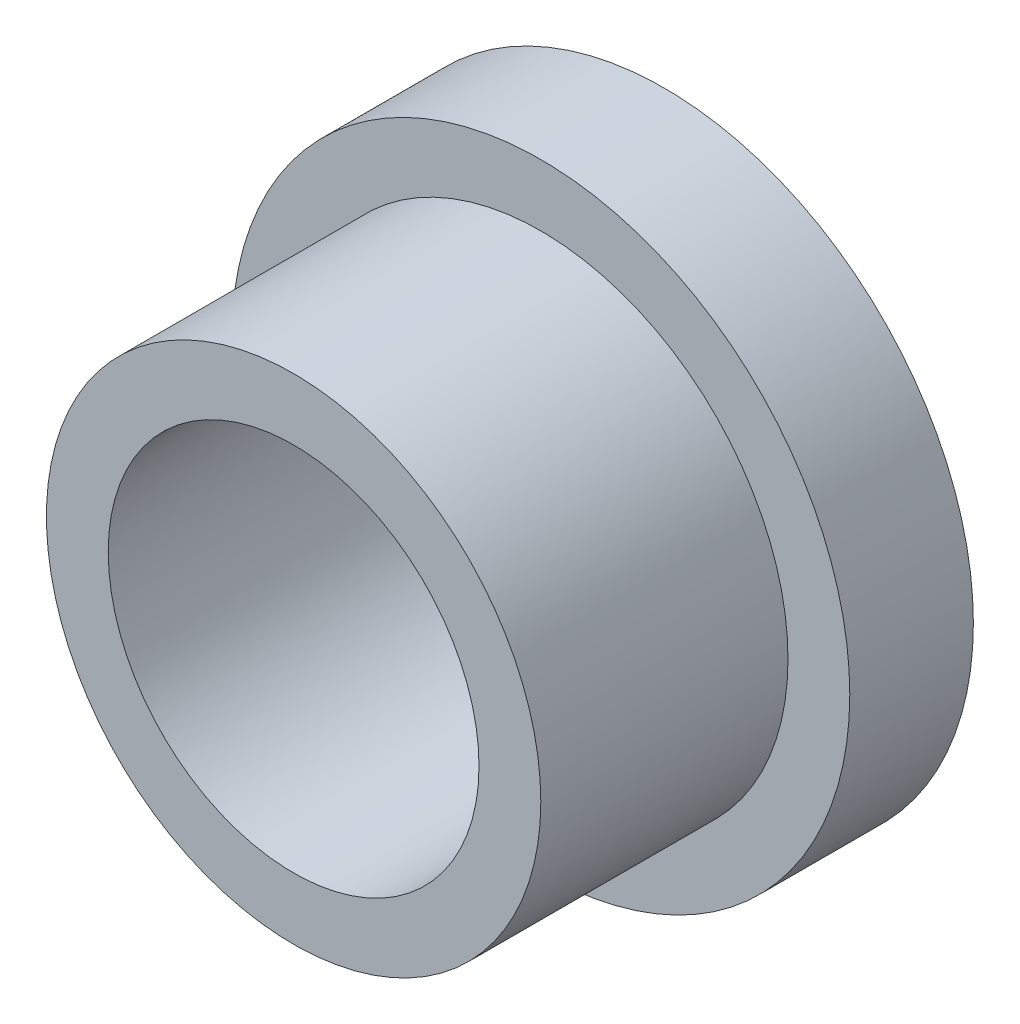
ISO-10303-21;
HEADER;
FILE_DESCRIPTION(('STEP AP214'),'2;1');
FILE_NAME('part.step','',(''),(''),'','','');
FILE_SCHEMA(('AUTOMOTIVE_DESIGN { 1 0 10303 214 1 1 1 1 }'));
ENDSEC;
DATA;
#1=APPLICATION_CONTEXT('core data for automotive mechanical design processes');
#2=APPLICATION_PROTOCOL_DEFINITION('international standard','automotive_design',2000,#1);
#3=PRODUCT_CONTEXT('',#1,'mechanical');
#4=PRODUCT('Part','Part','',(#3));
#5=PRODUCT_RELATED_PRODUCT_CATEGORY('part','',(#4));
#6=PRODUCT_DEFINITION_FORMATION('','',#4);
#7=PRODUCT_DEFINITION_CONTEXT('part definition',#1,'design');
#8=PRODUCT_DEFINITION('design','',#6,#7);
#9=PRODUCT_DEFINITION_SHAPE('','',#8);
#10=(LENGTH_UNIT() NAMED_UNIT(*) SI_UNIT(.MILLI.,.METRE.));
#11=(NAMED_UNIT(*) PLANE_ANGLE_UNIT() SI_UNIT($,.RADIAN.));
#12=(NAMED_UNIT(*) SI_UNIT($,.STERADIAN.) SOLID_ANGLE_UNIT());
#13=UNCERTAINTY_MEASURE_WITH_UNIT(LENGTH_MEASURE(1.E-05),#10,'distance_accuracy_value','');
#14=(GEOMETRIC_REPRESENTATION_CONTEXT(3) GLOBAL_UNCERTAINTY_ASSIGNED_CONTEXT((#13)) GLOBAL_UNIT_ASSIGNED_CONTEXT((#10,
#11,#12)) REPRESENTATION_CONTEXT('',''));
#15=CARTESIAN_POINT('',(0.,0.,0.));
#16=DIRECTION('',(0.,0.,1.));
#17=DIRECTION('',(1.,0.,0.));
#18=AXIS2_PLACEMENT_3D('',#15,#16,#17);
#19=CARTESIAN_POINT('',(0.,0.,6.));
#20=DIRECTION('',(0.,0.,1.));
#21=DIRECTION('',(1.,0.,0.));
#22=AXIS2_PLACEMENT_3D('',#19,#20,#21);
#23=PLANE('',#22);
#24=CARTESIAN_POINT('',(0.,0.,6.));
#25=DIRECTION('',(0.,0.,1.));
#26=DIRECTION('',(1.,0.,0.));
#27=AXIS2_PLACEMENT_3D('',#24,#25,#26);
#28=CIRCLE('',#27,3.);
#29=CARTESIAN_POINT('',(3.,0.,6.));
#30=VERTEX_POINT('',#29);
#31=EDGE_CURVE('E33',#30,#30,#28,.T.);
#32=ORIENTED_EDGE('',*,*,#31,.F.);
#33=EDGE_LOOP('',(#32));
#34=FACE_BOUND('',#33,.T.);
#35=CARTESIAN_POINT('',(0.,0.,6.));
#36=DIRECTION('',(0.,0.,1.));
#37=DIRECTION('',(1.,0.,0.));
#38=AXIS2_PLACEMENT_3D('',#35,#36,#37);
#39=CIRCLE('',#38,4.);
#40=CARTESIAN_POINT('',(4.,0.,6.));
#41=VERTEX_POINT('',#40);
#42=EDGE_CURVE('E45',#41,#41,#39,.T.);
#43=ORIENTED_EDGE('',*,*,#42,.T.);
#44=EDGE_LOOP('',(#43));
#45=FACE_BOUND('',#44,.T.);
#46=ADVANCED_FACE('F25',(#34,#45),#23,.T.);
#47=CARTESIAN_POINT('',(0.,0.,6.));
#48=DIRECTION('',(0.,0.,-1.));
#49=DIRECTION('',(-1.,0.,0.));
#50=AXIS2_PLACEMENT_3D('',#47,#48,#49);
#51=CYLINDRICAL_SURFACE('',#50,5.);
#52=CARTESIAN_POINT('',(0.,0.,0.));
#53=DIRECTION('',(0.,0.,1.));
#54=DIRECTION('',(1.,0.,0.));
#55=AXIS2_PLACEMENT_3D('',#52,#53,#54);
#56=CIRCLE('',#55,5.);
#57=CARTESIAN_POINT('',(5.,0.,0.));
#58=VERTEX_POINT('',#57);
#59=EDGE_CURVE('E10',#58,#58,#56,.T.);
#60=ORIENTED_EDGE('',*,*,#59,.T.);
#61=EDGE_LOOP('',(#60));
#62=FACE_BOUND('',#61,.T.);
#63=CARTESIAN_POINT('',(0.,0.,2.));
#64=DIRECTION('',(0.,0.,1.));
#65=DIRECTION('',(1.,0.,0.));
#66=AXIS2_PLACEMENT_3D('',#63,#64,#65);
#67=CIRCLE('',#66,5.);
#68=CARTESIAN_POINT('',(5.,0.,2.));
#69=VERTEX_POINT('',#68);
#70=EDGE_CURVE('E29',#69,#69,#67,.T.);
#71=ORIENTED_EDGE('',*,*,#70,.F.);
#72=EDGE_LOOP('',(#71));
#73=FACE_BOUND('',#72,.T.);
#74=ADVANCED_FACE('F27',(#62,#73),#51,.T.);
#75=CARTESIAN_POINT('',(0.,0.,0.));
#76=DIRECTION('',(0.,0.,1.));
#77=DIRECTION('',(1.,0.,0.));
#78=AXIS2_PLACEMENT_3D('',#75,#76,#77);
#79=PLANE('',#78);
#80=ORIENTED_EDGE('',*,*,#59,.F.);
#81=EDGE_LOOP('',(#80));
#82=FACE_BOUND('',#81,.T.);
#83=CARTESIAN_POINT('',(0.,0.,0.));
#84=DIRECTION('',(0.,0.,1.));
#85=DIRECTION('',(1.,0.,0.));
#86=AXIS2_PLACEMENT_3D('',#83,#84,#85);
#87=CIRCLE('',#86,3.);
#88=CARTESIAN_POINT('',(3.,0.,0.));
#89=VERTEX_POINT('',#88);
#90=EDGE_CURVE('E37',#89,#89,#87,.T.);
#91=ORIENTED_EDGE('',*,*,#90,.T.);
#92=EDGE_LOOP('',(#91));
#93=FACE_BOUND('',#92,.T.);
#94=ADVANCED_FACE('F66',(#82,#93),#79,.F.);
#95=CARTESIAN_POINT('',(0.,0.,6.));
#96=DIRECTION('',(0.,0.,-1.));
#97=DIRECTION('',(-1.,0.,0.));
#98=AXIS2_PLACEMENT_3D('',#95,#96,#97);
#99=CYLINDRICAL_SURFACE('',#98,3.);
#100=ORIENTED_EDGE('',*,*,#31,.T.);
#101=EDGE_LOOP('',(#100));
#102=FACE_BOUND('',#101,.T.);
#103=ORIENTED_EDGE('',*,*,#90,.F.);
#104=EDGE_LOOP('',(#103));
#105=FACE_BOUND('',#104,.T.);
#106=ADVANCED_FACE('F58',(#102,#105),#99,.F.);
#107=CARTESIAN_POINT('',(0.,0.,2.));
#108=DIRECTION('',(0.,0.,1.));
#109=DIRECTION('',(1.,0.,0.));
#110=AXIS2_PLACEMENT_3D('',#107,#108,#109);
#111=PLANE('',#110);
#112=CARTESIAN_POINT('',(0.,0.,2.));
#113=DIRECTION('',(0.,0.,1.));
#114=DIRECTION('',(1.,0.,0.));
#115=AXIS2_PLACEMENT_3D('',#112,#113,#114);
#116=CIRCLE('',#115,4.);
#117=CARTESIAN_POINT('',(4.,0.,2.));
#118=VERTEX_POINT('',#117);
#119=EDGE_CURVE('E42',#118,#118,#116,.T.);
#120=ORIENTED_EDGE('',*,*,#119,.F.);
#121=EDGE_LOOP('',(#120));
#122=FACE_BOUND('',#121,.T.);
#123=ORIENTED_EDGE('',*,*,#70,.T.);
#124=EDGE_LOOP('',(#123));
#125=FACE_BOUND('',#124,.T.);
#126=ADVANCED_FACE('F52',(#122,#125),#111,.T.);
#127=CARTESIAN_POINT('',(0.,0.,2.));
#128=DIRECTION('',(0.,0.,1.));
#129=DIRECTION('',(1.,0.,0.));
#130=AXIS2_PLACEMENT_3D('',#127,#128,#129);
#131=CYLINDRICAL_SURFACE('',#130,4.);
#132=ORIENTED_EDGE('',*,*,#119,.T.);
#133=EDGE_LOOP('',(#132));
#134=FACE_BOUND('',#133,.T.);
#135=ORIENTED_EDGE('',*,*,#42,.F.);
#136=EDGE_LOOP('',(#135));
#137=FACE_BOUND('',#136,.T.);
#138=ADVANCED_FACE('F50',(#134,#137),#131,.T.);
#139=CLOSED_SHELL('',(#46,#74,#94,#106,#126,#138));
#140=MANIFOLD_SOLID_BREP('B2',#139);
#141=ADVANCED_BREP_SHAPE_REPRESENTATION('',(#18,#140),#14);
#142=SHAPE_DEFINITION_REPRESENTATION(#9,#141);
ENDSEC;
END-ISO-10303-21;
